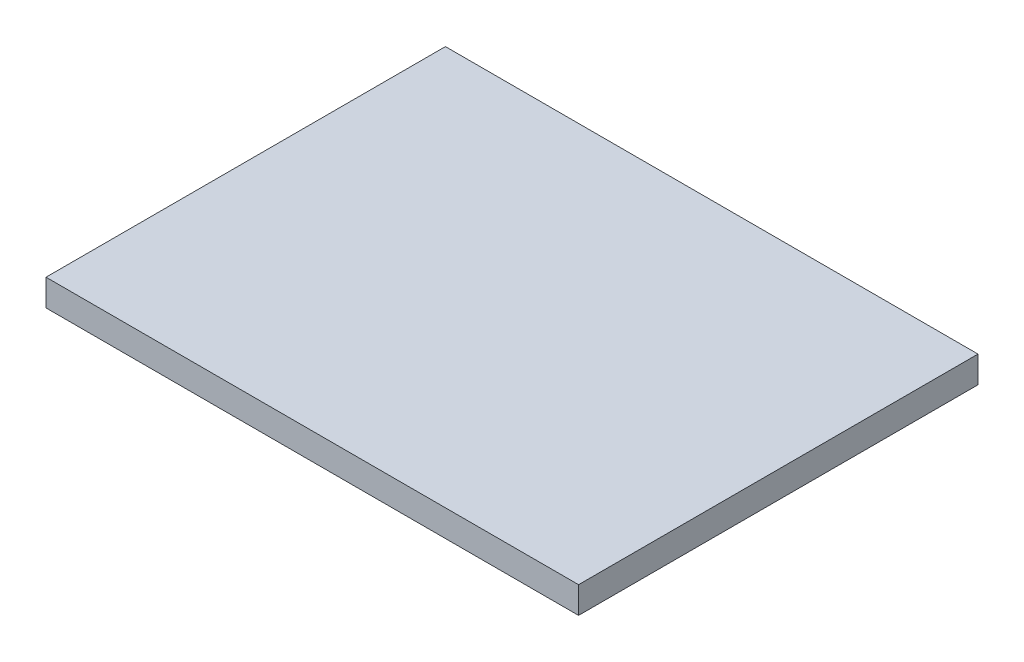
from build123d import *

# Parameters (mm, degrees)
SKETCH1_W           = 100
SKETCH1_H           = 75
BOSS_EXTRUDE1_DEPTH = 5


with BuildPart() as part:
    # Sketch1 → Boss-Extrude1 (new body)
    with BuildSketch(Plane(origin=(0, 0, 0), x_dir=(1, 0, 0), z_dir=(0, 1, 0))):
        Rectangle(SKETCH1_W, SKETCH1_H)
    extrude(amount=BOSS_EXTRUDE1_DEPTH)


solid = part.part
